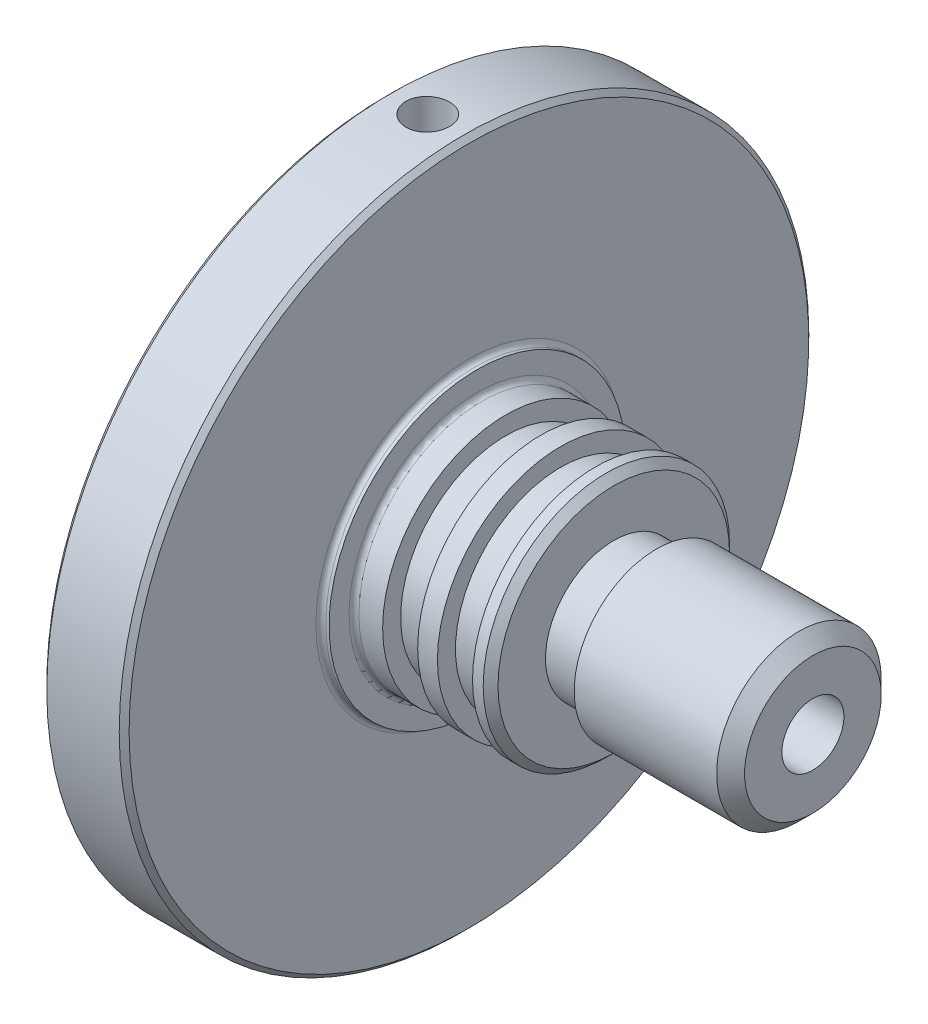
ISO-10303-21;
HEADER;
FILE_DESCRIPTION(('STEP AP214'),'2;1');
FILE_NAME('part.step','',(''),(''),'','','');
FILE_SCHEMA(('AUTOMOTIVE_DESIGN { 1 0 10303 214 1 1 1 1 }'));
ENDSEC;
DATA;
#1=APPLICATION_CONTEXT('core data for automotive mechanical design processes');
#2=APPLICATION_PROTOCOL_DEFINITION('international standard','automotive_design',2000,#1);
#3=PRODUCT_CONTEXT('',#1,'mechanical');
#4=PRODUCT('Part','Part','',(#3));
#5=PRODUCT_RELATED_PRODUCT_CATEGORY('part','',(#4));
#6=PRODUCT_DEFINITION_FORMATION('','',#4);
#7=PRODUCT_DEFINITION_CONTEXT('part definition',#1,'design');
#8=PRODUCT_DEFINITION('design','',#6,#7);
#9=PRODUCT_DEFINITION_SHAPE('','',#8);
#10=(LENGTH_UNIT() NAMED_UNIT(*) SI_UNIT(.MILLI.,.METRE.));
#11=(NAMED_UNIT(*) PLANE_ANGLE_UNIT() SI_UNIT($,.RADIAN.));
#12=(NAMED_UNIT(*) SI_UNIT($,.STERADIAN.) SOLID_ANGLE_UNIT());
#13=UNCERTAINTY_MEASURE_WITH_UNIT(LENGTH_MEASURE(1.E-05),#10,'distance_accuracy_value','');
#14=(GEOMETRIC_REPRESENTATION_CONTEXT(3) GLOBAL_UNCERTAINTY_ASSIGNED_CONTEXT((#13)) GLOBAL_UNIT_ASSIGNED_CONTEXT((#10,
#11,#12)) REPRESENTATION_CONTEXT('',''));
#15=CARTESIAN_POINT('',(0.,0.,0.));
#16=DIRECTION('',(0.,0.,1.));
#17=DIRECTION('',(1.,0.,0.));
#18=AXIS2_PLACEMENT_3D('',#15,#16,#17);
#19=CARTESIAN_POINT('',(109.664030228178,0.,0.));
#20=DIRECTION('',(1.,0.,0.));
#21=DIRECTION('',(0.,0.,-1.));
#22=AXIS2_PLACEMENT_3D('',#19,#20,#21);
#23=CYLINDRICAL_SURFACE('',#22,10.541);
#24=CARTESIAN_POINT('',(40.386,0.,0.));
#25=DIRECTION('',(1.,0.,0.));
#26=DIRECTION('',(0.,0.,-1.));
#27=AXIS2_PLACEMENT_3D('',#24,#25,#26);
#28=CIRCLE('',#27,10.541);
#29=CARTESIAN_POINT('',(40.386,0.,-10.541));
#30=VERTEX_POINT('',#29);
#31=EDGE_CURVE('E479',#30,#30,#28,.T.);
#32=ORIENTED_EDGE('',*,*,#31,.F.);
#33=EDGE_LOOP('',(#32));
#34=FACE_BOUND('',#33,.T.);
#35=CARTESIAN_POINT('',(35.052,0.,0.));
#36=DIRECTION('',(1.,0.,0.));
#37=DIRECTION('',(0.,0.,-1.));
#38=AXIS2_PLACEMENT_3D('',#35,#36,#37);
#39=CIRCLE('',#38,10.541);
#40=CARTESIAN_POINT('',(35.052,0.,-10.541));
#41=VERTEX_POINT('',#40);
#42=EDGE_CURVE('E437',#41,#41,#39,.T.);
#43=ORIENTED_EDGE('',*,*,#42,.T.);
#44=EDGE_LOOP('',(#43));
#45=FACE_BOUND('',#44,.T.);
#46=ADVANCED_FACE('F383',(#34,#45),#23,.T.);
#47=CARTESIAN_POINT('',(40.386,0.,0.));
#48=DIRECTION('',(1.,0.,0.));
#49=DIRECTION('',(0.,0.,-1.));
#50=AXIS2_PLACEMENT_3D('',#47,#48,#49);
#51=CONICAL_SURFACE('',#50,10.541,1.0471975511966);
#52=CARTESIAN_POINT('',(41.6324992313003,0.,0.));
#53=DIRECTION('',(1.,0.,0.));
#54=DIRECTION('',(0.,0.,-1.));
#55=AXIS2_PLACEMENT_3D('',#52,#53,#54);
#56=CIRCLE('',#55,12.7000000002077);
#57=CARTESIAN_POINT('',(41.6324992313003,0.,-12.7000000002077));
#58=VERTEX_POINT('',#57);
#59=EDGE_CURVE('E476',#58,#58,#56,.T.);
#60=ORIENTED_EDGE('',*,*,#59,.F.);
#61=EDGE_LOOP('',(#60));
#62=FACE_BOUND('',#61,.T.);
#63=ORIENTED_EDGE('',*,*,#31,.T.);
#64=EDGE_LOOP('',(#63));
#65=FACE_BOUND('',#64,.T.);
#66=ADVANCED_FACE('F614',(#62,#65),#51,.T.);
#67=CARTESIAN_POINT('',(109.664030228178,0.,0.));
#68=DIRECTION('',(1.,0.,0.));
#69=DIRECTION('',(0.,0.,-1.));
#70=AXIS2_PLACEMENT_3D('',#67,#68,#69);
#71=CYLINDRICAL_SURFACE('',#70,12.7000000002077);
#72=CARTESIAN_POINT('',(63.6269999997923,0.,0.));
#73=DIRECTION('',(1.,0.,0.));
#74=DIRECTION('',(0.,0.,-1.));
#75=AXIS2_PLACEMENT_3D('',#72,#73,#74);
#76=CIRCLE('',#75,12.7000000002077);
#77=CARTESIAN_POINT('',(63.6269999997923,0.,-12.7000000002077));
#78=VERTEX_POINT('',#77);
#79=EDGE_CURVE('E473',#78,#78,#76,.T.);
#80=ORIENTED_EDGE('',*,*,#79,.F.);
#81=EDGE_LOOP('',(#80));
#82=FACE_BOUND('',#81,.T.);
#83=ORIENTED_EDGE('',*,*,#59,.T.);
#84=EDGE_LOOP('',(#83));
#85=FACE_BOUND('',#84,.T.);
#86=ADVANCED_FACE('F619',(#82,#85),#71,.T.);
#87=CARTESIAN_POINT('',(63.6269999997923,0.,0.));
#88=DIRECTION('',(-1.,0.,0.));
#89=DIRECTION('',(0.,0.,1.));
#90=AXIS2_PLACEMENT_3D('',#87,#88,#89);
#91=CONICAL_SURFACE('',#90,12.7000000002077,0.785398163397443);
#92=CARTESIAN_POINT('',(65.786,0.,0.));
#93=DIRECTION('',(1.,0.,0.));
#94=DIRECTION('',(0.,0.,-1.));
#95=AXIS2_PLACEMENT_3D('',#92,#93,#94);
#96=CIRCLE('',#95,10.541);
#97=CARTESIAN_POINT('',(65.786,0.,-10.541));
#98=VERTEX_POINT('',#97);
#99=EDGE_CURVE('E470',#98,#98,#96,.T.);
#100=ORIENTED_EDGE('',*,*,#99,.F.);
#101=EDGE_LOOP('',(#100));
#102=FACE_BOUND('',#101,.T.);
#103=ORIENTED_EDGE('',*,*,#79,.T.);
#104=EDGE_LOOP('',(#103));
#105=FACE_BOUND('',#104,.T.);
#106=ADVANCED_FACE('F629',(#102,#105),#91,.T.);
#107=CARTESIAN_POINT('',(65.786,-10.541,0.));
#108=DIRECTION('',(-1.,0.,0.));
#109=DIRECTION('',(0.,0.,1.));
#110=AXIS2_PLACEMENT_3D('',#107,#108,#109);
#111=PLANE('',#110);
#112=CARTESIAN_POINT('',(65.786,0.,0.));
#113=DIRECTION('',(1.,0.,0.));
#114=DIRECTION('',(0.,0.,-1.));
#115=AXIS2_PLACEMENT_3D('',#112,#113,#114);
#116=CIRCLE('',#115,4.7879);
#117=CARTESIAN_POINT('',(65.786,0.,-4.7879));
#118=VERTEX_POINT('',#117);
#119=EDGE_CURVE('E421',#118,#118,#116,.T.);
#120=ORIENTED_EDGE('',*,*,#119,.F.);
#121=EDGE_LOOP('',(#120));
#122=FACE_BOUND('',#121,.T.);
#123=ORIENTED_EDGE('',*,*,#99,.T.);
#124=EDGE_LOOP('',(#123));
#125=FACE_BOUND('',#124,.T.);
#126=ADVANCED_FACE('F636',(#122,#125),#111,.F.);
#127=CARTESIAN_POINT('',(32.6393674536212,0.,0.));
#128=DIRECTION('',(-1.,0.,0.));
#129=DIRECTION('',(0.,0.,1.));
#130=AXIS2_PLACEMENT_3D('',#127,#128,#129);
#131=CONICAL_SURFACE('',#130,0.,1.0471975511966);
#132=CARTESIAN_POINT('',(28.9731932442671,0.,0.));
#133=DIRECTION('',(-1.,0.,0.));
#134=DIRECTION('',(0.,0.,1.));
#135=AXIS2_PLACEMENT_3D('',#132,#133,#134);
#136=CIRCLE('',#135,6.34999999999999);
#137=CARTESIAN_POINT('',(28.9731932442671,0.,6.34999999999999));
#138=VERTEX_POINT('',#137);
#139=EDGE_CURVE('E436',#138,#138,#136,.F.);
#140=ORIENTED_EDGE('',*,*,#139,.T.);
#141=EDGE_LOOP('',(#140));
#142=FACE_BOUND('',#141,.T.);
#143=CARTESIAN_POINT('',(26.67,0.,0.));
#144=DIRECTION('',(1.,0.,0.));
#145=DIRECTION('',(0.,0.,-1.));
#146=AXIS2_PLACEMENT_3D('',#143,#144,#145);
#147=CIRCLE('',#146,10.33924771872);
#148=CARTESIAN_POINT('',(26.67,0.,-10.33924771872));
#149=VERTEX_POINT('',#148);
#150=EDGE_CURVE('E467',#149,#149,#147,.T.);
#151=ORIENTED_EDGE('',*,*,#150,.F.);
#152=EDGE_LOOP('',(#151));
#153=FACE_BOUND('',#152,.T.);
#154=ADVANCED_FACE('F640',(#142,#153),#131,.F.);
#155=CARTESIAN_POINT('',(109.664030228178,0.,0.));
#156=DIRECTION('',(1.,0.,0.));
#157=DIRECTION('',(0.,0.,-1.));
#158=AXIS2_PLACEMENT_3D('',#155,#156,#157);
#159=CYLINDRICAL_SURFACE('',#158,10.33924771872);
#160=CARTESIAN_POINT('',(1.14300000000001,0.,0.));
#161=DIRECTION('',(1.,0.,0.));
#162=DIRECTION('',(0.,0.,-1.));
#163=AXIS2_PLACEMENT_3D('',#160,#161,#162);
#164=CIRCLE('',#163,10.33924771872);
#165=CARTESIAN_POINT('',(1.14300000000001,0.,-10.33924771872));
#166=VERTEX_POINT('',#165);
#167=EDGE_CURVE('E507',#166,#166,#164,.F.);
#168=ORIENTED_EDGE('',*,*,#167,.T.);
#169=EDGE_LOOP('',(#168));
#170=FACE_BOUND('',#169,.T.);
#171=ORIENTED_EDGE('',*,*,#150,.T.);
#172=EDGE_LOOP('',(#171));
#173=FACE_BOUND('',#172,.T.);
#174=ADVANCED_FACE('F644',(#170,#173),#159,.F.);
#175=CARTESIAN_POINT('',(0.,-53.213,0.));
#176=DIRECTION('',(1.,0.,0.));
#177=DIRECTION('',(0.,0.,-1.));
#178=AXIS2_PLACEMENT_3D('',#175,#176,#177);
#179=PLANE('',#178);
#180=CARTESIAN_POINT('',(0.,0.,0.));
#181=DIRECTION('',(1.,0.,0.));
#182=DIRECTION('',(0.,0.,-1.));
#183=AXIS2_PLACEMENT_3D('',#180,#181,#182);
#184=CIRCLE('',#183,52.451);
#185=CARTESIAN_POINT('',(0.,0.,-52.451));
#186=VERTEX_POINT('',#185);
#187=EDGE_CURVE('E11',#186,#186,#184,.F.);
#188=ORIENTED_EDGE('',*,*,#187,.T.);
#189=EDGE_LOOP('',(#188));
#190=FACE_BOUND('',#189,.T.);
#191=CARTESIAN_POINT('',(0.,0.,0.));
#192=DIRECTION('',(1.,0.,0.));
#193=DIRECTION('',(0.,0.,-1.));
#194=AXIS2_PLACEMENT_3D('',#191,#192,#193);
#195=CIRCLE('',#194,11.48224771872);
#196=CARTESIAN_POINT('',(0.,0.,-11.48224771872));
#197=VERTEX_POINT('',#196);
#198=EDGE_CURVE('E500',#197,#197,#195,.T.);
#199=ORIENTED_EDGE('',*,*,#198,.T.);
#200=EDGE_LOOP('',(#199));
#201=FACE_BOUND('',#200,.T.);
#202=ADVANCED_FACE('F609',(#190,#201),#179,.F.);
#203=CARTESIAN_POINT('',(109.664030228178,0.,0.));
#204=DIRECTION('',(1.,0.,0.));
#205=DIRECTION('',(0.,0.,-1.));
#206=AXIS2_PLACEMENT_3D('',#203,#204,#205);
#207=CYLINDRICAL_SURFACE('',#206,53.213);
#208=CARTESIAN_POINT('',(11.938,0.,0.));
#209=DIRECTION('',(-1.,0.,0.));
#210=DIRECTION('',(0.,0.,1.));
#211=AXIS2_PLACEMENT_3D('',#208,#209,#210);
#212=CIRCLE('',#211,53.213);
#213=CARTESIAN_POINT('',(11.938,0.,53.213));
#214=VERTEX_POINT('',#213);
#215=EDGE_CURVE('E390',#214,#214,#212,.T.);
#216=ORIENTED_EDGE('',*,*,#215,.T.);
#217=EDGE_LOOP('',(#216));
#218=FACE_BOUND('',#217,.T.);
#219=CARTESIAN_POINT('',(0.762000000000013,0.,0.));
#220=DIRECTION('',(1.,0.,0.));
#221=DIRECTION('',(0.,0.,-1.));
#222=AXIS2_PLACEMENT_3D('',#219,#220,#221);
#223=CIRCLE('',#222,53.213);
#224=CARTESIAN_POINT('',(0.762000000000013,0.,-53.213));
#225=VERTEX_POINT('',#224);
#226=EDGE_CURVE('E663',#225,#225,#223,.T.);
#227=ORIENTED_EDGE('',*,*,#226,.T.);
#228=EDGE_LOOP('',(#227));
#229=FACE_BOUND('',#228,.T.);
#230=CARTESIAN_POINT('',(6.35,-53.1059587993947,-3.37350099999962));
#231=CARTESIAN_POINT('',(6.16071336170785,-53.1059602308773,-3.37349267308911));
#232=CARTESIAN_POINT('',(5.97129432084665,-53.1069817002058,-3.35751619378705));
#233=CARTESIAN_POINT('',(5.59768696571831,-53.110957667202,-3.29401241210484));
#234=CARTESIAN_POINT('',(5.4135049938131,-53.1139144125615,-3.24644842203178));
#235=CARTESIAN_POINT('',(5.05583758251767,-53.1214246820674,-3.12114166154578));
#236=CARTESIAN_POINT('',(4.88234653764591,-53.1259773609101,-3.04341486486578));
#237=CARTESIAN_POINT('',(4.55091899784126,-53.1361654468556,-2.86001480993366));
#238=CARTESIAN_POINT('',(4.39297896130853,-53.1418006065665,-2.75434793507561));
#239=CARTESIAN_POINT('',(4.09684792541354,-53.1535285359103,-2.51788863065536));
#240=CARTESIAN_POINT('',(3.95868409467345,-53.1596219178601,-2.38706220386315));
#241=CARTESIAN_POINT('',(3.70625997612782,-53.1715740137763,-2.10406769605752));
#242=CARTESIAN_POINT('',(3.59200068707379,-53.1774327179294,-1.95189872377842));
#243=CARTESIAN_POINT('',(3.3905457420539,-53.1882606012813,-1.63038555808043));
#244=CARTESIAN_POINT('',(3.30337252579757,-53.193229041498,-1.46102727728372));
#245=CARTESIAN_POINT('',(3.15870794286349,-53.2017101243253,-1.110041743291));
#246=CARTESIAN_POINT('',(3.1012162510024,-53.205222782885,-0.928414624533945));
#247=CARTESIAN_POINT('',(3.01762197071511,-53.2103922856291,-0.558308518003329));
#248=CARTESIAN_POINT('',(2.99147688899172,-53.2120516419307,-0.369839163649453));
#249=CARTESIAN_POINT('',(2.97118676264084,-53.2133360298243,0.00881988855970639));
#250=CARTESIAN_POINT('',(2.97704134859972,-53.2129610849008,0.199009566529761));
#251=CARTESIAN_POINT('',(3.02054932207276,-53.2102212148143,0.575422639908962));
#252=CARTESIAN_POINT('',(3.05815699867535,-53.2078591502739,0.761651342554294));
#253=CARTESIAN_POINT('',(3.16403266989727,-53.2014142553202,1.12514734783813));
#254=CARTESIAN_POINT('',(3.23230084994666,-53.1973314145,1.3024145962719));
#255=CARTESIAN_POINT('',(3.39761137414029,-53.1878997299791,1.64310240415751));
#256=CARTESIAN_POINT('',(3.49467442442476,-53.1825499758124,1.80651289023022));
#257=CARTESIAN_POINT('',(3.71480435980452,-53.1711865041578,2.11473853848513));
#258=CARTESIAN_POINT('',(3.837871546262,-53.1651727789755,2.25955348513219));
#259=CARTESIAN_POINT('',(4.10677447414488,-53.1531456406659,2.52674410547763));
#260=CARTESIAN_POINT('',(4.25264989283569,-53.1471322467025,2.64907985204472));
#261=CARTESIAN_POINT('',(4.56288943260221,-53.1357942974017,2.86753154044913));
#262=CARTESIAN_POINT('',(4.72725356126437,-53.130469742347,2.96364747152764));
#263=CARTESIAN_POINT('',(5.06983029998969,-53.1211107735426,3.12692835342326));
#264=CARTESIAN_POINT('',(5.24804372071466,-53.117076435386,3.1940916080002));
#265=CARTESIAN_POINT('',(5.61324851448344,-53.1107555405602,3.29753297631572));
#266=CARTESIAN_POINT('',(5.80023978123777,-53.1084689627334,3.33381146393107));
#267=CARTESIAN_POINT('',(6.17734394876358,-53.10590541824,3.37440371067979));
#268=CARTESIAN_POINT('',(6.36745085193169,-53.1056249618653,3.37877297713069));
#269=CARTESIAN_POINT('',(6.74569603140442,-53.1070961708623,3.35556779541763));
#270=CARTESIAN_POINT('',(6.93383431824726,-53.1088478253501,3.32799351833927));
#271=CARTESIAN_POINT('',(7.30264465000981,-53.1141826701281,3.24173009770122));
#272=CARTESIAN_POINT('',(7.48332270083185,-53.1177643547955,3.18306653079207));
#273=CARTESIAN_POINT('',(7.83226917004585,-53.1263543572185,3.03631568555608));
#274=CARTESIAN_POINT('',(8.00053747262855,-53.1313626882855,2.94822813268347));
#275=CARTESIAN_POINT('',(8.32014285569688,-53.1422500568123,2.74498800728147));
#276=CARTESIAN_POINT('',(8.47145624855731,-53.1481302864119,2.62979824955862));
#277=CARTESIAN_POINT('',(8.7526179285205,-53.1600946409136,2.37567763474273));
#278=CARTESIAN_POINT('',(8.88246599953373,-53.1661787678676,2.23674653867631));
#279=CARTESIAN_POINT('',(9.11719868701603,-53.1778755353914,1.938848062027));
#280=CARTESIAN_POINT('',(9.22204737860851,-53.1834874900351,1.77985234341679));
#281=CARTESIAN_POINT('',(9.40355917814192,-53.1935976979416,1.44648039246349));
#282=CARTESIAN_POINT('',(9.48022246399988,-53.1980959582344,1.27210425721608));
#283=CARTESIAN_POINT('',(9.60312480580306,-53.2054686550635,0.913053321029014));
#284=CARTESIAN_POINT('',(9.64938657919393,-53.208344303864,0.728386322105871));
#285=CARTESIAN_POINT('',(9.71024703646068,-53.2121525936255,0.353887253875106));
#286=CARTESIAN_POINT('',(9.72484604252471,-53.2130852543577,0.164055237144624));
#287=CARTESIAN_POINT('',(9.72196340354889,-53.2129025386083,-0.215029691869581));
#288=CARTESIAN_POINT('',(9.70453797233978,-53.2117907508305,-0.404283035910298));
#289=CARTESIAN_POINT('',(9.63821767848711,-53.2076512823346,-0.777170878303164));
#290=CARTESIAN_POINT('',(9.58932276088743,-53.2046235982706,-0.96080536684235));
#291=CARTESIAN_POINT('',(9.46146418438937,-53.196992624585,-1.31725107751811));
#292=CARTESIAN_POINT('',(9.38250078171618,-53.1923893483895,-1.49006239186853));
#293=CARTESIAN_POINT('',(9.19675447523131,-53.1821239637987,-1.81998196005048));
#294=CARTESIAN_POINT('',(9.08997228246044,-53.1764618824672,-1.97709061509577));
#295=CARTESIAN_POINT('',(8.8514116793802,-53.1647039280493,-2.27143033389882));
#296=CARTESIAN_POINT('',(8.71959259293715,-53.1586073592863,-2.40862840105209));
#297=CARTESIAN_POINT('',(8.43475539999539,-53.1466731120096,-2.65899628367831));
#298=CARTESIAN_POINT('',(8.28173211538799,-53.140835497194,-2.7721602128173));
#299=CARTESIAN_POINT('',(7.95865092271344,-53.1300718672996,-2.97133384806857));
#300=CARTESIAN_POINT('',(7.78857172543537,-53.125147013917,-3.05730904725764));
#301=CARTESIAN_POINT('',(7.43648442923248,-53.1167813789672,-3.1993775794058));
#302=CARTESIAN_POINT('',(7.25449057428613,-53.1133388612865,-3.25550588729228));
#303=CARTESIAN_POINT('',(6.95115393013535,-53.1092292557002,-3.32170991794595));
#304=CARTESIAN_POINT('',(6.83177157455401,-53.1080083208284,-3.34110643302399));
#305=CARTESIAN_POINT('',(6.59161079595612,-53.1063726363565,-3.36700462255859));
#306=CARTESIAN_POINT('',(6.4708323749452,-53.1059578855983,-3.37350631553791));
#307=CARTESIAN_POINT('',(6.35,-53.1059587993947,-3.37350099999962));
#308=B_SPLINE_CURVE_WITH_KNOTS('',3,(#230,#231,#232,#233,#234,#235,#236,#237,#238,#239,#240,
#241,#242,#243,#244,#245,#246,#247,#248,#249,#250,#251,#252,#253,#254,#255,#256,#257,#258,#259,
#260,#261,#262,#263,#264,#265,#266,#267,#268,#269,#270,#271,#272,#273,#274,#275,#276,#277,#278,
#279,#280,#281,#282,#283,#284,#285,#286,#287,#288,#289,#290,#291,#292,#293,#294,#295,#296,#297,
#298,#299,#300,#301,#302,#303,#304,#305,#306,#307),.UNSPECIFIED.,.T.,.F.,(4,2,2,2,2,2,2,2,2,2,2,
2,2,2,2,2,2,2,2,2,2,2,2,2,2,2,2,2,2,2,2,2,2,2,2,2,2,2,4),(0.,0.567418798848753,1.13549778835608,
1.7032763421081,2.27092528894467,2.83934673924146,3.40779193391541,3.97670681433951,
4.54561546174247,5.11375202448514,5.68188202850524,6.24919555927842,6.81651252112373,
7.38423842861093,7.95197091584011,8.52070225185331,9.08943382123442,9.65819870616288,
10.2269567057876,10.7947250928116,11.3624904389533,11.9297894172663,12.497093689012,
13.0651809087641,13.6332738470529,14.2021782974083,14.7710791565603,15.3395544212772,
15.9080239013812,16.4754964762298,17.0429700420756,17.6104387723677,18.1778929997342,
18.7462771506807,19.3148003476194,19.8840422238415,20.4526155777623,20.8148316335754,
21.1770471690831),.UNSPECIFIED.);
#309=CARTESIAN_POINT('',(6.35,-53.1059587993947,-3.37350099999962));
#310=VERTEX_POINT('',#309);
#311=EDGE_CURVE('E418',#310,#310,#308,.T.);
#312=ORIENTED_EDGE('',*,*,#311,.T.);
#313=EDGE_LOOP('',(#312));
#314=FACE_BOUND('',#313,.T.);
#315=CARTESIAN_POINT('',(6.35,53.1059587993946,3.37350099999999));
#316=CARTESIAN_POINT('',(6.16071336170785,53.1059602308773,3.37349267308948));
#317=CARTESIAN_POINT('',(5.97129432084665,53.1069817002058,3.35751619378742));
#318=CARTESIAN_POINT('',(5.59768696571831,53.110957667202,3.29401241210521));
#319=CARTESIAN_POINT('',(5.4135049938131,53.1139144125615,3.24644842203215));
#320=CARTESIAN_POINT('',(5.05583758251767,53.1214246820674,3.12114166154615));
#321=CARTESIAN_POINT('',(4.88234653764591,53.1259773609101,3.04341486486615));
#322=CARTESIAN_POINT('',(4.55091899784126,53.1361654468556,2.86001480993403));
#323=CARTESIAN_POINT('',(4.39297896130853,53.1418006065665,2.75434793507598));
#324=CARTESIAN_POINT('',(4.09684792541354,53.1535285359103,2.51788863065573));
#325=CARTESIAN_POINT('',(3.95868409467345,53.1596219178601,2.38706220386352));
#326=CARTESIAN_POINT('',(3.70625997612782,53.1715740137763,2.10406769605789));
#327=CARTESIAN_POINT('',(3.59200068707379,53.1774327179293,1.95189872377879));
#328=CARTESIAN_POINT('',(3.3905457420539,53.1882606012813,1.6303855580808));
#329=CARTESIAN_POINT('',(3.30337252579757,53.193229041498,1.46102727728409));
#330=CARTESIAN_POINT('',(3.15870794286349,53.2017101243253,1.11004174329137));
#331=CARTESIAN_POINT('',(3.1012162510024,53.2052227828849,0.928414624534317));
#332=CARTESIAN_POINT('',(3.01762197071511,53.2103922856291,0.558308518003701));
#333=CARTESIAN_POINT('',(2.99147688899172,53.2120516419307,0.369839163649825));
#334=CARTESIAN_POINT('',(2.97118676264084,53.2133360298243,-0.00881988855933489));
#335=CARTESIAN_POINT('',(2.97704134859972,53.2129610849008,-0.199009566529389));
#336=CARTESIAN_POINT('',(3.02054932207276,53.2102212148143,-0.57542263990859));
#337=CARTESIAN_POINT('',(3.05815699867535,53.2078591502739,-0.761651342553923));
#338=CARTESIAN_POINT('',(3.16403266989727,53.2014142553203,-1.12514734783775));
#339=CARTESIAN_POINT('',(3.23230084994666,53.1973314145,-1.30241459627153));
#340=CARTESIAN_POINT('',(3.39761137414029,53.1878997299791,-1.64310240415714));
#341=CARTESIAN_POINT('',(3.49467442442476,53.1825499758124,-1.80651289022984));
#342=CARTESIAN_POINT('',(3.71480435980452,53.1711865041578,-2.11473853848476));
#343=CARTESIAN_POINT('',(3.837871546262,53.1651727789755,-2.25955348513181));
#344=CARTESIAN_POINT('',(4.10677447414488,53.1531456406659,-2.52674410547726));
#345=CARTESIAN_POINT('',(4.25264989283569,53.1471322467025,-2.64907985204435));
#346=CARTESIAN_POINT('',(4.56288943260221,53.1357942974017,-2.86753154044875));
#347=CARTESIAN_POINT('',(4.72725356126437,53.130469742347,-2.96364747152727));
#348=CARTESIAN_POINT('',(5.06983029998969,53.1211107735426,-3.12692835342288));
#349=CARTESIAN_POINT('',(5.24804372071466,53.117076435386,-3.19409160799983));
#350=CARTESIAN_POINT('',(5.61324851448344,53.1107555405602,-3.29753297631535));
#351=CARTESIAN_POINT('',(5.80023978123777,53.1084689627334,-3.3338114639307));
#352=CARTESIAN_POINT('',(6.17734394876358,53.10590541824,-3.37440371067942));
#353=CARTESIAN_POINT('',(6.36745085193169,53.1056249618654,-3.37877297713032));
#354=CARTESIAN_POINT('',(6.74569603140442,53.1070961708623,-3.35556779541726));
#355=CARTESIAN_POINT('',(6.93383431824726,53.1088478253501,-3.3279935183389));
#356=CARTESIAN_POINT('',(7.30264465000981,53.1141826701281,-3.24173009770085));
#357=CARTESIAN_POINT('',(7.48332270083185,53.1177643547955,-3.1830665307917));
#358=CARTESIAN_POINT('',(7.83226917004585,53.1263543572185,-3.03631568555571));
#359=CARTESIAN_POINT('',(8.00053747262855,53.1313626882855,-2.9482281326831));
#360=CARTESIAN_POINT('',(8.32014285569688,53.1422500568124,-2.7449880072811));
#361=CARTESIAN_POINT('',(8.47145624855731,53.148130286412,-2.62979824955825));
#362=CARTESIAN_POINT('',(8.7526179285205,53.1600946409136,-2.37567763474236));
#363=CARTESIAN_POINT('',(8.88246599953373,53.1661787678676,-2.23674653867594));
#364=CARTESIAN_POINT('',(9.11719868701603,53.1778755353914,-1.93884806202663));
#365=CARTESIAN_POINT('',(9.22204737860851,53.1834874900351,-1.77985234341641));
#366=CARTESIAN_POINT('',(9.40355917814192,53.1935976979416,-1.44648039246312));
#367=CARTESIAN_POINT('',(9.48022246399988,53.1980959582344,-1.27210425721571));
#368=CARTESIAN_POINT('',(9.60312480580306,53.2054686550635,-0.913053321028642));
#369=CARTESIAN_POINT('',(9.64938657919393,53.208344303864,-0.728386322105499));
#370=CARTESIAN_POINT('',(9.71024703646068,53.2121525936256,-0.353887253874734));
#371=CARTESIAN_POINT('',(9.72484604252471,53.2130852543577,-0.164055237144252));
#372=CARTESIAN_POINT('',(9.72196340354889,53.2129025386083,0.215029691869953));
#373=CARTESIAN_POINT('',(9.70453797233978,53.2117907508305,0.40428303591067));
#374=CARTESIAN_POINT('',(9.63821767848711,53.2076512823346,0.777170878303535));
#375=CARTESIAN_POINT('',(9.58932276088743,53.2046235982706,0.960805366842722));
#376=CARTESIAN_POINT('',(9.46146418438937,53.1969926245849,1.31725107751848));
#377=CARTESIAN_POINT('',(9.38250078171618,53.1923893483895,1.49006239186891));
#378=CARTESIAN_POINT('',(9.19675447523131,53.1821239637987,1.81998196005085));
#379=CARTESIAN_POINT('',(9.08997228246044,53.1764618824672,1.97709061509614));
#380=CARTESIAN_POINT('',(8.8514116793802,53.1647039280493,2.27143033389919));
#381=CARTESIAN_POINT('',(8.71959259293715,53.1586073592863,2.40862840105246));
#382=CARTESIAN_POINT('',(8.43475539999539,53.1466731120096,2.65899628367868));
#383=CARTESIAN_POINT('',(8.28173211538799,53.140835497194,2.77216021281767));
#384=CARTESIAN_POINT('',(7.95865092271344,53.1300718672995,2.97133384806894));
#385=CARTESIAN_POINT('',(7.78857172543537,53.125147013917,3.05730904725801));
#386=CARTESIAN_POINT('',(7.43648442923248,53.1167813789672,3.19937757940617));
#387=CARTESIAN_POINT('',(7.25449057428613,53.1133388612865,3.25550588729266));
#388=CARTESIAN_POINT('',(6.95115393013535,53.1092292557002,3.32170991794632));
#389=CARTESIAN_POINT('',(6.83177157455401,53.1080083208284,3.34110643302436));
#390=CARTESIAN_POINT('',(6.59161079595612,53.1063726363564,3.36700462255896));
#391=CARTESIAN_POINT('',(6.4708323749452,53.1059578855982,3.37350631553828));
#392=CARTESIAN_POINT('',(6.35,53.1059587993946,3.37350099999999));
#393=B_SPLINE_CURVE_WITH_KNOTS('',3,(#315,#316,#317,#318,#319,#320,#321,#322,#323,#324,#325,
#326,#327,#328,#329,#330,#331,#332,#333,#334,#335,#336,#337,#338,#339,#340,#341,#342,#343,#344,
#345,#346,#347,#348,#349,#350,#351,#352,#353,#354,#355,#356,#357,#358,#359,#360,#361,#362,#363,
#364,#365,#366,#367,#368,#369,#370,#371,#372,#373,#374,#375,#376,#377,#378,#379,#380,#381,#382,
#383,#384,#385,#386,#387,#388,#389,#390,#391,#392),.UNSPECIFIED.,.T.,.F.,(4,2,2,2,2,2,2,2,2,2,2,
2,2,2,2,2,2,2,2,2,2,2,2,2,2,2,2,2,2,2,2,2,2,2,2,2,2,2,4),(0.,0.567418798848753,1.13549778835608,
1.7032763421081,2.27092528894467,2.83934673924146,3.40779193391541,3.97670681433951,
4.54561546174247,5.11375202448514,5.68188202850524,6.24919555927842,6.81651252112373,
7.38423842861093,7.95197091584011,8.52070225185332,9.08943382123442,9.65819870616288,
10.2269567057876,10.7947250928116,11.3624904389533,11.9297894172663,12.497093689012,
13.0651809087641,13.6332738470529,14.2021782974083,14.7710791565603,15.3395544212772,
15.9080239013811,16.4754964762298,17.0429700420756,17.6104387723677,18.1778929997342,
18.7462771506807,19.3148003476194,19.8840422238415,20.4526155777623,20.8148316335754,
21.1770471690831),.UNSPECIFIED.);
#394=CARTESIAN_POINT('',(9.723501,53.213,0.));
#395=VERTEX_POINT('',#394);
#396=CARTESIAN_POINT('',(2.97649900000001,53.213,0.));
#397=VERTEX_POINT('',#396);
#398=EDGE_CURVE('E399',#395,#397,#393,.T.);
#399=ORIENTED_EDGE('',*,*,#398,.T.);
#400=EDGE_CURVE('E396',#397,#395,#393,.T.);
#401=ORIENTED_EDGE('',*,*,#400,.T.);
#402=EDGE_LOOP('',(#399,#401));
#403=FACE_BOUND('',#402,.T.);
#404=ADVANCED_FACE('F517',(#218,#229,#314,#403),#207,.T.);
#405=CARTESIAN_POINT('',(12.7,-53.213,0.));
#406=DIRECTION('',(-1.,0.,0.));
#407=DIRECTION('',(0.,0.,1.));
#408=AXIS2_PLACEMENT_3D('',#405,#406,#407);
#409=PLANE('',#408);
#410=CARTESIAN_POINT('',(12.7,0.,0.));
#411=DIRECTION('',(-1.,0.,0.));
#412=DIRECTION('',(0.,0.,1.));
#413=AXIS2_PLACEMENT_3D('',#410,#411,#412);
#414=CIRCLE('',#413,52.451);
#415=CARTESIAN_POINT('',(12.7,0.,52.451));
#416=VERTEX_POINT('',#415);
#417=EDGE_CURVE('E515',#416,#416,#414,.F.);
#418=ORIENTED_EDGE('',*,*,#417,.T.);
#419=EDGE_LOOP('',(#418));
#420=FACE_BOUND('',#419,.T.);
#421=CARTESIAN_POINT('',(12.7,0.,0.));
#422=DIRECTION('',(-1.,0.,0.));
#423=DIRECTION('',(0.,0.,1.));
#424=AXIS2_PLACEMENT_3D('',#421,#422,#423);
#425=CIRCLE('',#424,23.622);
#426=CARTESIAN_POINT('',(12.7,0.,23.622));
#427=VERTEX_POINT('',#426);
#428=EDGE_CURVE('E497',#427,#427,#425,.T.);
#429=ORIENTED_EDGE('',*,*,#428,.T.);
#430=EDGE_LOOP('',(#429));
#431=FACE_BOUND('',#430,.T.);
#432=ADVANCED_FACE('F601',(#420,#431),#409,.F.);
#433=CARTESIAN_POINT('',(109.664030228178,0.,0.));
#434=DIRECTION('',(1.,0.,0.));
#435=DIRECTION('',(0.,0.,-1.));
#436=AXIS2_PLACEMENT_3D('',#433,#434,#435);
#437=CYLINDRICAL_SURFACE('',#436,22.86);
#438=CARTESIAN_POINT('',(13.462,0.,0.));
#439=DIRECTION('',(-1.,0.,0.));
#440=DIRECTION('',(0.,0.,1.));
#441=AXIS2_PLACEMENT_3D('',#438,#439,#440);
#442=CIRCLE('',#441,22.86);
#443=CARTESIAN_POINT('',(13.462,0.,22.86));
#444=VERTEX_POINT('',#443);
#445=EDGE_CURVE('E494',#444,#444,#442,.F.);
#446=ORIENTED_EDGE('',*,*,#445,.T.);
#447=EDGE_LOOP('',(#446));
#448=FACE_BOUND('',#447,.T.);
#449=CARTESIAN_POINT('',(13.97,0.,0.));
#450=DIRECTION('',(1.,0.,0.));
#451=DIRECTION('',(0.,0.,-1.));
#452=AXIS2_PLACEMENT_3D('',#449,#450,#451);
#453=CIRCLE('',#452,22.86);
#454=CARTESIAN_POINT('',(13.97,0.,-22.86));
#455=VERTEX_POINT('',#454);
#456=EDGE_CURVE('E464',#455,#455,#453,.T.);
#457=ORIENTED_EDGE('',*,*,#456,.F.);
#458=EDGE_LOOP('',(#457));
#459=FACE_BOUND('',#458,.T.);
#460=ADVANCED_FACE('F598',(#448,#459),#437,.T.);
#461=CARTESIAN_POINT('',(13.97,-22.86,0.));
#462=DIRECTION('',(-1.,0.,0.));
#463=DIRECTION('',(0.,0.,1.));
#464=AXIS2_PLACEMENT_3D('',#461,#462,#463);
#465=PLANE('',#464);
#466=CARTESIAN_POINT('',(13.97,0.,0.));
#467=DIRECTION('',(-1.,0.,0.));
#468=DIRECTION('',(0.,0.,1.));
#469=AXIS2_PLACEMENT_3D('',#466,#467,#468);
#470=CIRCLE('',#469,19.7739);
#471=CARTESIAN_POINT('',(13.97,0.,19.7739));
#472=VERTEX_POINT('',#471);
#473=EDGE_CURVE('E485',#472,#472,#470,.T.);
#474=ORIENTED_EDGE('',*,*,#473,.T.);
#475=EDGE_LOOP('',(#474));
#476=FACE_BOUND('',#475,.T.);
#477=ORIENTED_EDGE('',*,*,#456,.T.);
#478=EDGE_LOOP('',(#477));
#479=FACE_BOUND('',#478,.T.);
#480=ADVANCED_FACE('F594',(#476,#479),#465,.F.);
#481=CARTESIAN_POINT('',(109.664030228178,0.,0.));
#482=DIRECTION('',(1.,0.,0.));
#483=DIRECTION('',(0.,0.,-1.));
#484=AXIS2_PLACEMENT_3D('',#481,#482,#483);
#485=CYLINDRICAL_SURFACE('',#484,19.0119);
#486=CARTESIAN_POINT('',(14.732,0.,0.));
#487=DIRECTION('',(-1.,0.,0.));
#488=DIRECTION('',(0.,0.,1.));
#489=AXIS2_PLACEMENT_3D('',#486,#487,#488);
#490=CIRCLE('',#489,19.0119);
#491=CARTESIAN_POINT('',(14.732,0.,19.0119));
#492=VERTEX_POINT('',#491);
#493=EDGE_CURVE('E482',#492,#492,#490,.F.);
#494=ORIENTED_EDGE('',*,*,#493,.T.);
#495=EDGE_LOOP('',(#494));
#496=FACE_BOUND('',#495,.T.);
#497=CARTESIAN_POINT('',(18.3896,0.,0.));
#498=DIRECTION('',(1.,0.,0.));
#499=DIRECTION('',(0.,0.,-1.));
#500=AXIS2_PLACEMENT_3D('',#497,#498,#499);
#501=CIRCLE('',#500,19.0119);
#502=CARTESIAN_POINT('',(18.3896,0.,-19.0119));
#503=VERTEX_POINT('',#502);
#504=EDGE_CURVE('E461',#503,#503,#501,.T.);
#505=ORIENTED_EDGE('',*,*,#504,.F.);
#506=EDGE_LOOP('',(#505));
#507=FACE_BOUND('',#506,.T.);
#508=ADVANCED_FACE('F590',(#496,#507),#485,.T.);
#509=CARTESIAN_POINT('',(18.3896,-16.2306,0.));
#510=DIRECTION('',(-1.,0.,0.));
#511=DIRECTION('',(0.,0.,1.));
#512=AXIS2_PLACEMENT_3D('',#509,#510,#511);
#513=PLANE('',#512);
#514=CARTESIAN_POINT('',(18.3896,0.,0.));
#515=DIRECTION('',(1.,0.,0.));
#516=DIRECTION('',(0.,0.,-1.));
#517=AXIS2_PLACEMENT_3D('',#514,#515,#516);
#518=CIRCLE('',#517,16.2306);
#519=CARTESIAN_POINT('',(18.3896,0.,-16.2306));
#520=VERTEX_POINT('',#519);
#521=EDGE_CURVE('E458',#520,#520,#518,.T.);
#522=ORIENTED_EDGE('',*,*,#521,.F.);
#523=EDGE_LOOP('',(#522));
#524=FACE_BOUND('',#523,.T.);
#525=ORIENTED_EDGE('',*,*,#504,.T.);
#526=EDGE_LOOP('',(#525));
#527=FACE_BOUND('',#526,.T.);
#528=ADVANCED_FACE('F586',(#524,#527),#513,.F.);
#529=CARTESIAN_POINT('',(109.664030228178,0.,0.));
#530=DIRECTION('',(1.,0.,0.));
#531=DIRECTION('',(0.,0.,-1.));
#532=AXIS2_PLACEMENT_3D('',#529,#530,#531);
#533=CYLINDRICAL_SURFACE('',#532,16.2306);
#534=CARTESIAN_POINT('',(23.7998000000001,0.,0.));
#535=DIRECTION('',(1.,0.,0.));
#536=DIRECTION('',(0.,0.,-1.));
#537=AXIS2_PLACEMENT_3D('',#534,#535,#536);
#538=CIRCLE('',#537,16.2306);
#539=CARTESIAN_POINT('',(23.7998000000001,0.,-16.2306));
#540=VERTEX_POINT('',#539);
#541=EDGE_CURVE('E455',#540,#540,#538,.T.);
#542=ORIENTED_EDGE('',*,*,#541,.F.);
#543=EDGE_LOOP('',(#542));
#544=FACE_BOUND('',#543,.T.);
#545=ORIENTED_EDGE('',*,*,#521,.T.);
#546=EDGE_LOOP('',(#545));
#547=FACE_BOUND('',#546,.T.);
#548=ADVANCED_FACE('F582',(#544,#547),#533,.T.);
#549=CARTESIAN_POINT('',(23.7998,-16.2306,0.));
#550=DIRECTION('',(1.,0.,0.));
#551=DIRECTION('',(0.,0.,-1.));
#552=AXIS2_PLACEMENT_3D('',#549,#550,#551);
#553=PLANE('',#552);
#554=CARTESIAN_POINT('',(23.7998000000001,0.,0.));
#555=DIRECTION('',(1.,0.,0.));
#556=DIRECTION('',(0.,0.,-1.));
#557=AXIS2_PLACEMENT_3D('',#554,#555,#556);
#558=CIRCLE('',#557,19.0119);
#559=CARTESIAN_POINT('',(23.7998000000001,0.,-19.0119));
#560=VERTEX_POINT('',#559);
#561=EDGE_CURVE('E452',#560,#560,#558,.T.);
#562=ORIENTED_EDGE('',*,*,#561,.F.);
#563=EDGE_LOOP('',(#562));
#564=FACE_BOUND('',#563,.T.);
#565=ORIENTED_EDGE('',*,*,#541,.T.);
#566=EDGE_LOOP('',(#565));
#567=FACE_BOUND('',#566,.T.);
#568=ADVANCED_FACE('F578',(#564,#567),#553,.F.);
#569=CARTESIAN_POINT('',(109.664030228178,0.,0.));
#570=DIRECTION('',(1.,0.,0.));
#571=DIRECTION('',(0.,0.,-1.));
#572=AXIS2_PLACEMENT_3D('',#569,#570,#571);
#573=CYLINDRICAL_SURFACE('',#572,19.0119);
#574=CARTESIAN_POINT('',(26.8478,0.,0.));
#575=DIRECTION('',(1.,0.,0.));
#576=DIRECTION('',(0.,0.,-1.));
#577=AXIS2_PLACEMENT_3D('',#574,#575,#576);
#578=CIRCLE('',#577,19.0119);
#579=CARTESIAN_POINT('',(26.8478,0.,-19.0119));
#580=VERTEX_POINT('',#579);
#581=EDGE_CURVE('E449',#580,#580,#578,.T.);
#582=ORIENTED_EDGE('',*,*,#581,.F.);
#583=EDGE_LOOP('',(#582));
#584=FACE_BOUND('',#583,.T.);
#585=ORIENTED_EDGE('',*,*,#561,.T.);
#586=EDGE_LOOP('',(#585));
#587=FACE_BOUND('',#586,.T.);
#588=ADVANCED_FACE('F574',(#584,#587),#573,.T.);
#589=CARTESIAN_POINT('',(26.8478,-16.2306,0.));
#590=DIRECTION('',(-1.,0.,0.));
#591=DIRECTION('',(0.,0.,1.));
#592=AXIS2_PLACEMENT_3D('',#589,#590,#591);
#593=PLANE('',#592);
#594=CARTESIAN_POINT('',(26.8478,0.,0.));
#595=DIRECTION('',(1.,0.,0.));
#596=DIRECTION('',(0.,0.,-1.));
#597=AXIS2_PLACEMENT_3D('',#594,#595,#596);
#598=CIRCLE('',#597,16.2306);
#599=CARTESIAN_POINT('',(26.8478,0.,-16.2306));
#600=VERTEX_POINT('',#599);
#601=EDGE_CURVE('E446',#600,#600,#598,.T.);
#602=ORIENTED_EDGE('',*,*,#601,.F.);
#603=EDGE_LOOP('',(#602));
#604=FACE_BOUND('',#603,.T.);
#605=ORIENTED_EDGE('',*,*,#581,.T.);
#606=EDGE_LOOP('',(#605));
#607=FACE_BOUND('',#606,.T.);
#608=ADVANCED_FACE('F570',(#604,#607),#593,.F.);
#609=CARTESIAN_POINT('',(109.664030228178,0.,0.));
#610=DIRECTION('',(1.,0.,0.));
#611=DIRECTION('',(0.,0.,-1.));
#612=AXIS2_PLACEMENT_3D('',#609,#610,#611);
#613=CYLINDRICAL_SURFACE('',#612,16.2306);
#614=CARTESIAN_POINT('',(32.258,0.,0.));
#615=DIRECTION('',(1.,0.,0.));
#616=DIRECTION('',(0.,0.,-1.));
#617=AXIS2_PLACEMENT_3D('',#614,#615,#616);
#618=CIRCLE('',#617,16.2306);
#619=CARTESIAN_POINT('',(32.258,0.,-16.2306));
#620=VERTEX_POINT('',#619);
#621=EDGE_CURVE('E443',#620,#620,#618,.T.);
#622=ORIENTED_EDGE('',*,*,#621,.F.);
#623=EDGE_LOOP('',(#622));
#624=FACE_BOUND('',#623,.T.);
#625=ORIENTED_EDGE('',*,*,#601,.T.);
#626=EDGE_LOOP('',(#625));
#627=FACE_BOUND('',#626,.T.);
#628=ADVANCED_FACE('F566',(#624,#627),#613,.T.);
#629=CARTESIAN_POINT('',(32.258,-16.2306,0.));
#630=DIRECTION('',(1.,0.,0.));
#631=DIRECTION('',(0.,0.,-1.));
#632=AXIS2_PLACEMENT_3D('',#629,#630,#631);
#633=PLANE('',#632);
#634=CARTESIAN_POINT('',(32.258,0.,0.));
#635=DIRECTION('',(1.,0.,0.));
#636=DIRECTION('',(0.,0.,-1.));
#637=AXIS2_PLACEMENT_3D('',#634,#635,#636);
#638=CIRCLE('',#637,19.0119);
#639=CARTESIAN_POINT('',(32.258,0.,-19.0119));
#640=VERTEX_POINT('',#639);
#641=EDGE_CURVE('E440',#640,#640,#638,.T.);
#642=ORIENTED_EDGE('',*,*,#641,.F.);
#643=EDGE_LOOP('',(#642));
#644=FACE_BOUND('',#643,.T.);
#645=ORIENTED_EDGE('',*,*,#621,.T.);
#646=EDGE_LOOP('',(#645));
#647=FACE_BOUND('',#646,.T.);
#648=ADVANCED_FACE('F562',(#644,#647),#633,.F.);
#649=CARTESIAN_POINT('',(109.664030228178,0.,0.));
#650=DIRECTION('',(1.,0.,0.));
#651=DIRECTION('',(0.,0.,-1.));
#652=AXIS2_PLACEMENT_3D('',#649,#650,#651);
#653=CYLINDRICAL_SURFACE('',#652,19.0119);
#654=CARTESIAN_POINT('',(33.909,0.,0.));
#655=DIRECTION('',(-1.,0.,0.));
#656=DIRECTION('',(0.,0.,1.));
#657=AXIS2_PLACEMENT_3D('',#654,#655,#656);
#658=CIRCLE('',#657,19.0119);
#659=CARTESIAN_POINT('',(33.909,0.,19.0119));
#660=VERTEX_POINT('',#659);
#661=EDGE_CURVE('E491',#660,#660,#658,.T.);
#662=ORIENTED_EDGE('',*,*,#661,.T.);
#663=EDGE_LOOP('',(#662));
#664=FACE_BOUND('',#663,.T.);
#665=ORIENTED_EDGE('',*,*,#641,.T.);
#666=EDGE_LOOP('',(#665));
#667=FACE_BOUND('',#666,.T.);
#668=ADVANCED_FACE('F558',(#664,#667),#653,.T.);
#669=CARTESIAN_POINT('',(35.052,-19.0119,0.));
#670=DIRECTION('',(-1.,0.,0.));
#671=DIRECTION('',(0.,0.,1.));
#672=AXIS2_PLACEMENT_3D('',#669,#670,#671);
#673=PLANE('',#672);
#674=CARTESIAN_POINT('',(35.052,0.,0.));
#675=DIRECTION('',(-1.,0.,0.));
#676=DIRECTION('',(0.,0.,1.));
#677=AXIS2_PLACEMENT_3D('',#674,#675,#676);
#678=CIRCLE('',#677,17.8689);
#679=CARTESIAN_POINT('',(35.052,0.,17.8689));
#680=VERTEX_POINT('',#679);
#681=EDGE_CURVE('E488',#680,#680,#678,.F.);
#682=ORIENTED_EDGE('',*,*,#681,.T.);
#683=EDGE_LOOP('',(#682));
#684=FACE_BOUND('',#683,.T.);
#685=ORIENTED_EDGE('',*,*,#42,.F.);
#686=EDGE_LOOP('',(#685));
#687=FACE_BOUND('',#686,.T.);
#688=ADVANCED_FACE('F554',(#684,#687),#673,.F.);
#689=CARTESIAN_POINT('',(14.732,0.,0.));
#690=DIRECTION('',(-1.,0.,0.));
#691=DIRECTION('',(0.,0.,1.));
#692=AXIS2_PLACEMENT_3D('',#689,#690,#691);
#693=TOROIDAL_SURFACE('',#692,19.7739,0.762);
#694=ORIENTED_EDGE('',*,*,#473,.F.);
#695=EDGE_LOOP('',(#694));
#696=FACE_BOUND('',#695,.T.);
#697=ORIENTED_EDGE('',*,*,#493,.F.);
#698=EDGE_LOOP('',(#697));
#699=FACE_BOUND('',#698,.T.);
#700=ADVANCED_FACE('F550',(#696,#699),#693,.F.);
#701=CARTESIAN_POINT('',(35.052,0.,0.));
#702=DIRECTION('',(-1.,0.,0.));
#703=DIRECTION('',(0.,0.,1.));
#704=AXIS2_PLACEMENT_3D('',#701,#702,#703);
#705=CONICAL_SURFACE('',#704,17.8689,0.785398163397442);
#706=ORIENTED_EDGE('',*,*,#661,.F.);
#707=EDGE_LOOP('',(#706));
#708=FACE_BOUND('',#707,.T.);
#709=ORIENTED_EDGE('',*,*,#681,.F.);
#710=EDGE_LOOP('',(#709));
#711=FACE_BOUND('',#710,.T.);
#712=ADVANCED_FACE('F546',(#708,#711),#705,.T.);
#713=CARTESIAN_POINT('',(13.462,0.,0.));
#714=DIRECTION('',(-1.,0.,0.));
#715=DIRECTION('',(0.,0.,1.));
#716=AXIS2_PLACEMENT_3D('',#713,#714,#715);
#717=TOROIDAL_SURFACE('',#716,23.622,0.762);
#718=ORIENTED_EDGE('',*,*,#428,.F.);
#719=EDGE_LOOP('',(#718));
#720=FACE_BOUND('',#719,.T.);
#721=ORIENTED_EDGE('',*,*,#445,.F.);
#722=EDGE_LOOP('',(#721));
#723=FACE_BOUND('',#722,.T.);
#724=ADVANCED_FACE('F542',(#720,#723),#717,.F.);
#725=CARTESIAN_POINT('',(0.,0.,0.));
#726=DIRECTION('',(-1.,0.,0.));
#727=DIRECTION('',(0.,0.,1.));
#728=AXIS2_PLACEMENT_3D('',#725,#726,#727);
#729=CYLINDRICAL_SURFACE('',#728,6.34999999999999);
#730=CARTESIAN_POINT('',(47.752,0.,0.));
#731=DIRECTION('',(-1.,0.,0.));
#732=DIRECTION('',(0.,0.,1.));
#733=AXIS2_PLACEMENT_3D('',#730,#731,#732);
#734=CIRCLE('',#733,6.34999999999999);
#735=CARTESIAN_POINT('',(47.752,0.,6.34999999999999));
#736=VERTEX_POINT('',#735);
#737=EDGE_CURVE('E433',#736,#736,#734,.T.);
#738=ORIENTED_EDGE('',*,*,#737,.F.);
#739=EDGE_LOOP('',(#738));
#740=FACE_BOUND('',#739,.T.);
#741=ORIENTED_EDGE('',*,*,#139,.F.);
#742=EDGE_LOOP('',(#741));
#743=FACE_BOUND('',#742,.T.);
#744=ADVANCED_FACE('F538',(#740,#743),#729,.F.);
#745=CARTESIAN_POINT('',(47.752,0.,0.));
#746=DIRECTION('',(-1.,0.,0.));
#747=DIRECTION('',(0.,0.,1.));
#748=AXIS2_PLACEMENT_3D('',#745,#746,#747);
#749=CONICAL_SURFACE('',#748,6.34999999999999,1.02974425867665);
#750=CARTESIAN_POINT('',(48.6906043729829,0.,0.));
#751=DIRECTION('',(-1.,0.,0.));
#752=DIRECTION('',(0.,0.,1.));
#753=AXIS2_PLACEMENT_3D('',#750,#751,#752);
#754=CIRCLE('',#753,4.7879);
#755=CARTESIAN_POINT('',(48.6906043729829,0.,4.7879));
#756=VERTEX_POINT('',#755);
#757=EDGE_CURVE('E432',#756,#756,#754,.F.);
#758=ORIENTED_EDGE('',*,*,#757,.T.);
#759=EDGE_LOOP('',(#758));
#760=FACE_BOUND('',#759,.T.);
#761=ORIENTED_EDGE('',*,*,#737,.T.);
#762=EDGE_LOOP('',(#761));
#763=FACE_BOUND('',#762,.T.);
#764=ADVANCED_FACE('F534',(#760,#763),#749,.F.);
#765=CARTESIAN_POINT('',(0.,0.,0.));
#766=DIRECTION('',(1.,0.,0.));
#767=DIRECTION('',(0.,0.,-1.));
#768=AXIS2_PLACEMENT_3D('',#765,#766,#767);
#769=CYLINDRICAL_SURFACE('',#768,4.7879);
#770=ORIENTED_EDGE('',*,*,#119,.T.);
#771=EDGE_LOOP('',(#770));
#772=FACE_BOUND('',#771,.T.);
#773=ORIENTED_EDGE('',*,*,#757,.F.);
#774=EDGE_LOOP('',(#773));
#775=FACE_BOUND('',#774,.T.);
#776=ADVANCED_FACE('F530',(#772,#775),#769,.F.);
#777=CARTESIAN_POINT('',(0.,0.,0.));
#778=DIRECTION('',(-1.,0.,0.));
#779=DIRECTION('',(0.,0.,1.));
#780=AXIS2_PLACEMENT_3D('',#777,#778,#779);
#781=CONICAL_SURFACE('',#780,11.48224771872,0.785398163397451);
#782=ORIENTED_EDGE('',*,*,#167,.F.);
#783=EDGE_LOOP('',(#782));
#784=FACE_BOUND('',#783,.T.);
#785=ORIENTED_EDGE('',*,*,#198,.F.);
#786=EDGE_LOOP('',(#785));
#787=FACE_BOUND('',#786,.T.);
#788=ADVANCED_FACE('F526',(#784,#787),#781,.F.);
#789=CARTESIAN_POINT('',(6.35,53.213,0.));
#790=DIRECTION('',(0.,1.,0.));
#791=DIRECTION('',(0.,0.,1.));
#792=AXIS2_PLACEMENT_3D('',#789,#790,#791);
#793=CYLINDRICAL_SURFACE('',#792,3.37350099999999);
#794=CARTESIAN_POINT('',(6.35,40.513,0.));
#795=DIRECTION('',(0.,1.,0.));
#796=DIRECTION('',(0.,0.,1.));
#797=AXIS2_PLACEMENT_3D('',#794,#795,#796);
#798=CIRCLE('',#797,3.37350099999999);
#799=CARTESIAN_POINT('',(6.35,40.513,3.37350099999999));
#800=VERTEX_POINT('',#799);
#801=EDGE_CURVE('E417',#800,#800,#798,.T.);
#802=ORIENTED_EDGE('',*,*,#801,.F.);
#803=EDGE_LOOP('',(#802));
#804=FACE_BOUND('',#803,.T.);
#805=ORIENTED_EDGE('',*,*,#398,.F.);
#806=ORIENTED_EDGE('',*,*,#400,.F.);
#807=EDGE_LOOP('',(#805,#806));
#808=FACE_BOUND('',#807,.T.);
#809=ADVANCED_FACE('F521',(#804,#808),#793,.F.);
#810=CARTESIAN_POINT('',(6.35,40.513,0.));
#811=DIRECTION('',(0.,1.,0.));
#812=DIRECTION('',(0.,0.,1.));
#813=AXIS2_PLACEMENT_3D('',#810,#811,#812);
#814=CONICAL_SURFACE('',#813,3.37350099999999,1.02974425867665);
#815=CARTESIAN_POINT('',(6.35,38.4859961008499,0.));
#816=VERTEX_POINT('',#815);
#817=VERTEX_LOOP('',#816);
#818=FACE_BOUND('',#817,.T.);
#819=ORIENTED_EDGE('',*,*,#801,.T.);
#820=EDGE_LOOP('',(#819));
#821=FACE_BOUND('',#820,.T.);
#822=ADVANCED_FACE('F412',(#818,#821),#814,.F.);
#823=CARTESIAN_POINT('',(6.35,-53.213,3.71584608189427E-13));
#824=DIRECTION('',(0.,-1.,0.));
#825=DIRECTION('',(0.,0.,-1.));
#826=AXIS2_PLACEMENT_3D('',#823,#824,#825);
#827=CYLINDRICAL_SURFACE('',#826,3.37350099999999);
#828=CARTESIAN_POINT('',(6.35,-40.513,2.83678555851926E-13));
#829=DIRECTION('',(0.,-1.,0.));
#830=DIRECTION('',(0.,0.,-1.));
#831=AXIS2_PLACEMENT_3D('',#828,#829,#830);
#832=CIRCLE('',#831,3.37350099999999);
#833=CARTESIAN_POINT('',(6.35,-40.513,-3.37350099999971));
#834=VERTEX_POINT('',#833);
#835=EDGE_CURVE('E415',#834,#834,#832,.T.);
#836=ORIENTED_EDGE('',*,*,#835,.F.);
#837=EDGE_LOOP('',(#836));
#838=FACE_BOUND('',#837,.T.);
#839=ORIENTED_EDGE('',*,*,#311,.F.);
#840=EDGE_LOOP('',(#839));
#841=FACE_BOUND('',#840,.T.);
#842=ADVANCED_FACE('F410',(#838,#841),#827,.F.);
#843=CARTESIAN_POINT('',(6.35,-40.513,2.83678555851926E-13));
#844=DIRECTION('',(0.,-1.,0.));
#845=DIRECTION('',(0.,0.,-1.));
#846=AXIS2_PLACEMENT_3D('',#843,#844,#845);
#847=CONICAL_SURFACE('',#846,3.37350099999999,1.02974425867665);
#848=CARTESIAN_POINT('',(6.35,-38.4859961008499,2.69648169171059E-13));
#849=VERTEX_POINT('',#848);
#850=VERTEX_LOOP('',#849);
#851=FACE_BOUND('',#850,.T.);
#852=ORIENTED_EDGE('',*,*,#835,.T.);
#853=EDGE_LOOP('',(#852));
#854=FACE_BOUND('',#853,.T.);
#855=ADVANCED_FACE('F406',(#851,#854),#847,.F.);
#856=CARTESIAN_POINT('',(12.7,0.,0.));
#857=DIRECTION('',(-1.,0.,0.));
#858=DIRECTION('',(0.,0.,1.));
#859=AXIS2_PLACEMENT_3D('',#856,#857,#858);
#860=CONICAL_SURFACE('',#859,52.451,0.785398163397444);
#861=CARTESIAN_POINT('',(11.938,0.,53.213));
#862=CARTESIAN_POINT('',(11.9459375,0.,53.2050625));
#863=CARTESIAN_POINT('',(11.953875,0.,53.197125));
#864=CARTESIAN_POINT('',(11.96975,0.,53.18125));
#865=CARTESIAN_POINT('',(11.9776875,0.,53.1733125));
#866=CARTESIAN_POINT('',(11.9935625,0.,53.1574375));
#867=CARTESIAN_POINT('',(12.0015,0.,53.1495));
#868=CARTESIAN_POINT('',(12.017375,0.,53.133625));
#869=CARTESIAN_POINT('',(12.0253125,0.,53.1256875));
#870=CARTESIAN_POINT('',(12.0411875,0.,53.1098125));
#871=CARTESIAN_POINT('',(12.049125,0.,53.101875));
#872=CARTESIAN_POINT('',(12.065,0.,53.086));
#873=CARTESIAN_POINT('',(12.0729375,0.,53.0780625));
#874=CARTESIAN_POINT('',(12.0888125,0.,53.0621875));
#875=CARTESIAN_POINT('',(12.09675,0.,53.05425));
#876=CARTESIAN_POINT('',(12.112625,0.,53.038375));
#877=CARTESIAN_POINT('',(12.1205625,0.,53.0304375));
#878=CARTESIAN_POINT('',(12.1364375,0.,53.0145625));
#879=CARTESIAN_POINT('',(12.144375,0.,53.006625));
#880=CARTESIAN_POINT('',(12.16025,0.,52.99075));
#881=CARTESIAN_POINT('',(12.1681875,0.,52.9828125));
#882=CARTESIAN_POINT('',(12.1840625,0.,52.9669375));
#883=CARTESIAN_POINT('',(12.192,0.,52.959));
#884=CARTESIAN_POINT('',(12.207875,0.,52.943125));
#885=CARTESIAN_POINT('',(12.2158125,0.,52.9351875));
#886=CARTESIAN_POINT('',(12.2316875,0.,52.9193125));
#887=CARTESIAN_POINT('',(12.239625,0.,52.911375));
#888=CARTESIAN_POINT('',(12.2555,0.,52.8955));
#889=CARTESIAN_POINT('',(12.2634375,0.,52.8875625));
#890=CARTESIAN_POINT('',(12.2793125,0.,52.8716875));
#891=CARTESIAN_POINT('',(12.28725,0.,52.86375));
#892=CARTESIAN_POINT('',(12.303125,0.,52.847875));
#893=CARTESIAN_POINT('',(12.3110625,0.,52.8399375));
#894=CARTESIAN_POINT('',(12.3269375,0.,52.8240625));
#895=CARTESIAN_POINT('',(12.334875,0.,52.816125));
#896=CARTESIAN_POINT('',(12.35075,0.,52.80025));
#897=CARTESIAN_POINT('',(12.3586875,0.,52.7923125));
#898=CARTESIAN_POINT('',(12.3745625,0.,52.7764375));
#899=CARTESIAN_POINT('',(12.3825,0.,52.7685));
#900=CARTESIAN_POINT('',(12.398375,0.,52.752625));
#901=CARTESIAN_POINT('',(12.4063125,0.,52.7446875));
#902=CARTESIAN_POINT('',(12.4221875,0.,52.7288125));
#903=CARTESIAN_POINT('',(12.430125,0.,52.720875));
#904=CARTESIAN_POINT('',(12.446,0.,52.705));
#905=CARTESIAN_POINT('',(12.4539375,0.,52.6970625));
#906=CARTESIAN_POINT('',(12.4698125,0.,52.6811875));
#907=CARTESIAN_POINT('',(12.47775,0.,52.67325));
#908=CARTESIAN_POINT('',(12.493625,0.,52.657375));
#909=CARTESIAN_POINT('',(12.5015625,0.,52.6494375));
#910=CARTESIAN_POINT('',(12.5174375,0.,52.6335625));
#911=CARTESIAN_POINT('',(12.525375,0.,52.625625));
#912=CARTESIAN_POINT('',(12.54125,0.,52.60975));
#913=CARTESIAN_POINT('',(12.5491875,0.,52.6018125));
#914=CARTESIAN_POINT('',(12.5650625,0.,52.5859375));
#915=CARTESIAN_POINT('',(12.573,0.,52.578));
#916=CARTESIAN_POINT('',(12.588875,0.,52.562125));
#917=CARTESIAN_POINT('',(12.5968125,0.,52.5541875));
#918=CARTESIAN_POINT('',(12.6126875,0.,52.5383125));
#919=CARTESIAN_POINT('',(12.620625,0.,52.530375));
#920=CARTESIAN_POINT('',(12.6365,0.,52.5145));
#921=CARTESIAN_POINT('',(12.6444375,0.,52.5065625));
#922=CARTESIAN_POINT('',(12.6603125,0.,52.4906875));
#923=CARTESIAN_POINT('',(12.66825,0.,52.48275));
#924=CARTESIAN_POINT('',(12.684125,0.,52.466875));
#925=CARTESIAN_POINT('',(12.6920625,0.,52.4589375));
#926=CARTESIAN_POINT('',(12.7,0.,52.451));
#927=B_SPLINE_CURVE_WITH_KNOTS('',3,(#861,#862,#863,#864,#865,#866,#867,#868,#869,#870,#871,
#872,#873,#874,#875,#876,#877,#878,#879,#880,#881,#882,#883,#884,#885,#886,#887,#888,#889,#890,
#891,#892,#893,#894,#895,#896,#897,#898,#899,#900,#901,#902,#903,#904,#905,#906,#907,#908,#909,
#910,#911,#912,#913,#914,#915,#916,#917,#918,#919,#920,#921,#922,#923,#924,#925,#926),
.UNSPECIFIED.,.F.,.F.,(4,2,2,2,2,2,2,2,2,2,2,2,2,2,2,2,2,2,2,2,2,2,2,2,2,2,2,2,2,2,2,2,4),(0.,
0.0336759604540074,0.067351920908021,0.101027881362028,0.134703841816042,0.168379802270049,
0.202055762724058,0.235731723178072,0.269407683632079,0.303083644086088,0.3367596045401,
0.370435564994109,0.404111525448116,0.43778748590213,0.471463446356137,0.505139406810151,
0.538815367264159,0.572491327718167,0.60616728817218,0.639843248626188,0.673519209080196,
0.707195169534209,0.740871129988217,0.774547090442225,0.808223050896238,0.841899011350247,
0.875574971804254,0.909250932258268,0.942926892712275,0.976602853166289,1.0102788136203,
1.0439547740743,1.07763073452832),.UNSPECIFIED.);
#928=EDGE_CURVE('BSEAM409',#214,#416,#927,.T.);
#929=ORIENTED_EDGE('',*,*,#215,.F.);
#930=ORIENTED_EDGE('',*,*,#417,.F.);
#931=ORIENTED_EDGE('',*,*,#928,.T.);
#932=ORIENTED_EDGE('',*,*,#928,.F.);
#933=EDGE_LOOP('',(#929,#931,#930,#932));
#934=FACE_BOUND('',#933,.T.);
#935=ADVANCED_FACE('F409',(#934),#860,.T.);
#936=CARTESIAN_POINT('',(0.762000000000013,0.,0.));
#937=DIRECTION('',(1.,0.,0.));
#938=DIRECTION('',(0.,0.,-1.));
#939=AXIS2_PLACEMENT_3D('',#936,#937,#938);
#940=CONICAL_SURFACE('',#939,53.213,0.785398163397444);
#941=CARTESIAN_POINT('',(0.,0.,-52.451));
#942=CARTESIAN_POINT('',(0.00793750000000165,0.,-52.4589375));
#943=CARTESIAN_POINT('',(0.0158750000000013,0.,-52.466875));
#944=CARTESIAN_POINT('',(0.0317500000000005,0.,-52.48275));
#945=CARTESIAN_POINT('',(0.0396875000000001,0.,-52.4906875));
#946=CARTESIAN_POINT('',(0.0555625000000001,0.,-52.5065625));
#947=CARTESIAN_POINT('',(0.0635000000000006,0.,-52.5145));
#948=CARTESIAN_POINT('',(0.0793750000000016,0.,-52.530375));
#949=CARTESIAN_POINT('',(0.0873125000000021,0.,-52.5383125));
#950=CARTESIAN_POINT('',(0.103187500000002,0.,-52.5541875));
#951=CARTESIAN_POINT('',(0.111125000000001,0.,-52.562125));
#952=CARTESIAN_POINT('',(0.127000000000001,0.,-52.578));
#953=CARTESIAN_POINT('',(0.134937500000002,0.,-52.5859375));
#954=CARTESIAN_POINT('',(0.150812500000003,0.,-52.6018125));
#955=CARTESIAN_POINT('',(0.158750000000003,0.,-52.60975));
#956=CARTESIAN_POINT('',(0.174625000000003,0.,-52.625625));
#957=CARTESIAN_POINT('',(0.182562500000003,0.,-52.6335625));
#958=CARTESIAN_POINT('',(0.198437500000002,0.,-52.6494375));
#959=CARTESIAN_POINT('',(0.206375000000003,0.,-52.657375));
#960=CARTESIAN_POINT('',(0.222250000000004,0.,-52.67325));
#961=CARTESIAN_POINT('',(0.230187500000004,0.,-52.6811875));
#962=CARTESIAN_POINT('',(0.246062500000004,0.,-52.6970625));
#963=CARTESIAN_POINT('',(0.254000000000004,0.,-52.705));
#964=CARTESIAN_POINT('',(0.269875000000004,0.,-52.720875));
#965=CARTESIAN_POINT('',(0.277812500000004,0.,-52.7288125));
#966=CARTESIAN_POINT('',(0.293687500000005,0.,-52.7446875));
#967=CARTESIAN_POINT('',(0.301625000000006,0.,-52.752625));
#968=CARTESIAN_POINT('',(0.317500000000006,0.,-52.7685));
#969=CARTESIAN_POINT('',(0.325437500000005,0.,-52.7764375));
#970=CARTESIAN_POINT('',(0.341312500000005,0.,-52.7923125));
#971=CARTESIAN_POINT('',(0.349250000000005,0.,-52.80025));
#972=CARTESIAN_POINT('',(0.365125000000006,0.,-52.816125));
#973=CARTESIAN_POINT('',(0.373062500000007,0.,-52.8240625));
#974=CARTESIAN_POINT('',(0.388937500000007,0.,-52.8399375));
#975=CARTESIAN_POINT('',(0.396875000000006,0.,-52.847875));
#976=CARTESIAN_POINT('',(0.412750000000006,0.,-52.86375));
#977=CARTESIAN_POINT('',(0.420687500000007,0.,-52.8716875));
#978=CARTESIAN_POINT('',(0.436562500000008,0.,-52.8875625));
#979=CARTESIAN_POINT('',(0.444500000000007,0.,-52.8955));
#980=CARTESIAN_POINT('',(0.460375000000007,0.,-52.911375));
#981=CARTESIAN_POINT('',(0.468312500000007,0.,-52.9193125));
#982=CARTESIAN_POINT('',(0.484187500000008,0.,-52.9351875));
#983=CARTESIAN_POINT('',(0.492125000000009,0.,-52.943125));
#984=CARTESIAN_POINT('',(0.508000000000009,0.,-52.959));
#985=CARTESIAN_POINT('',(0.515937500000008,0.,-52.9669375));
#986=CARTESIAN_POINT('',(0.531812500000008,0.,-52.9828125));
#987=CARTESIAN_POINT('',(0.539750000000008,0.,-52.99075));
#988=CARTESIAN_POINT('',(0.55562500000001,0.,-53.006625));
#989=CARTESIAN_POINT('',(0.56356250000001,0.,-53.0145625));
#990=CARTESIAN_POINT('',(0.57943750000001,0.,-53.0304375));
#991=CARTESIAN_POINT('',(0.587375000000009,0.,-53.038375));
#992=CARTESIAN_POINT('',(0.603250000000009,0.,-53.05425));
#993=CARTESIAN_POINT('',(0.61118750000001,0.,-53.0621875));
#994=CARTESIAN_POINT('',(0.627062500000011,0.,-53.0780625));
#995=CARTESIAN_POINT('',(0.635000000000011,0.,-53.086));
#996=CARTESIAN_POINT('',(0.650875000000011,0.,-53.101875));
#997=CARTESIAN_POINT('',(0.65881250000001,0.,-53.1098125));
#998=CARTESIAN_POINT('',(0.67468750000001,0.,-53.1256875));
#999=CARTESIAN_POINT('',(0.682625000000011,0.,-53.133625));
#1000=CARTESIAN_POINT('',(0.698500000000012,0.,-53.1495));
#1001=CARTESIAN_POINT('',(0.706437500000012,0.,-53.1574375));
#1002=CARTESIAN_POINT('',(0.722312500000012,0.,-53.1733125));
#1003=CARTESIAN_POINT('',(0.730250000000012,0.,-53.18125));
#1004=CARTESIAN_POINT('',(0.746125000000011,0.,-53.197125));
#1005=CARTESIAN_POINT('',(0.754062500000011,0.,-53.2050625));
#1006=CARTESIAN_POINT('',(0.762000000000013,0.,-53.213));
#1007=B_SPLINE_CURVE_WITH_KNOTS('',3,(#941,#942,#943,#944,#945,#946,#947,#948,#949,#950,#951,
#952,#953,#954,#955,#956,#957,#958,#959,#960,#961,#962,#963,#964,#965,#966,#967,#968,#969,#970,
#971,#972,#973,#974,#975,#976,#977,#978,#979,#980,#981,#982,#983,#984,#985,#986,#987,#988,#989,
#990,#991,#992,#993,#994,#995,#996,#997,#998,#999,#1000,#1001,#1002,#1003,#1004,#1005,#1006),
.UNSPECIFIED.,.F.,.F.,(4,2,2,2,2,2,2,2,2,2,2,2,2,2,2,2,2,2,2,2,2,2,2,2,2,2,2,2,2,2,2,2,4),(0.,
0.033675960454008,0.067351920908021,0.101027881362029,0.134703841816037,0.16837980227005,
0.202055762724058,0.235731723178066,0.269407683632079,0.303083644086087,0.336759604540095,
0.370435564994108,0.404111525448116,0.437787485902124,0.471463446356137,0.505139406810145,
0.538815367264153,0.572491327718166,0.606167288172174,0.639843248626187,0.673519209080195,
0.707195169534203,0.740871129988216,0.774547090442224,0.808223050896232,0.841899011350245,
0.875574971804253,0.909250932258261,0.942926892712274,0.976602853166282,1.01027881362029,
1.0439547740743,1.07763073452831),.UNSPECIFIED.);
#1008=EDGE_CURVE('BSEAM657',#186,#225,#1007,.T.);
#1009=ORIENTED_EDGE('',*,*,#187,.F.);
#1010=ORIENTED_EDGE('',*,*,#226,.F.);
#1011=ORIENTED_EDGE('',*,*,#1008,.T.);
#1012=ORIENTED_EDGE('',*,*,#1008,.F.);
#1013=EDGE_LOOP('',(#1009,#1011,#1010,#1012));
#1014=FACE_BOUND('',#1013,.T.);
#1015=ADVANCED_FACE('F657',(#1014),#940,.T.);
#1016=CLOSED_SHELL('',(#46,#66,#86,#106,#126,#154,#174,#202,#404,#432,#460,#480,#508,#528,#548,
#568,#588,#608,#628,#648,#668,#688,#700,#712,#724,#744,#764,#776,#788,#809,#822,#842,#855,#935,#1015));
#1017=MANIFOLD_SOLID_BREP('B2',#1016);
#1018=ADVANCED_BREP_SHAPE_REPRESENTATION('',(#18,#1017),#14);
#1019=SHAPE_DEFINITION_REPRESENTATION(#9,#1018);
ENDSEC;
END-ISO-10303-21;
